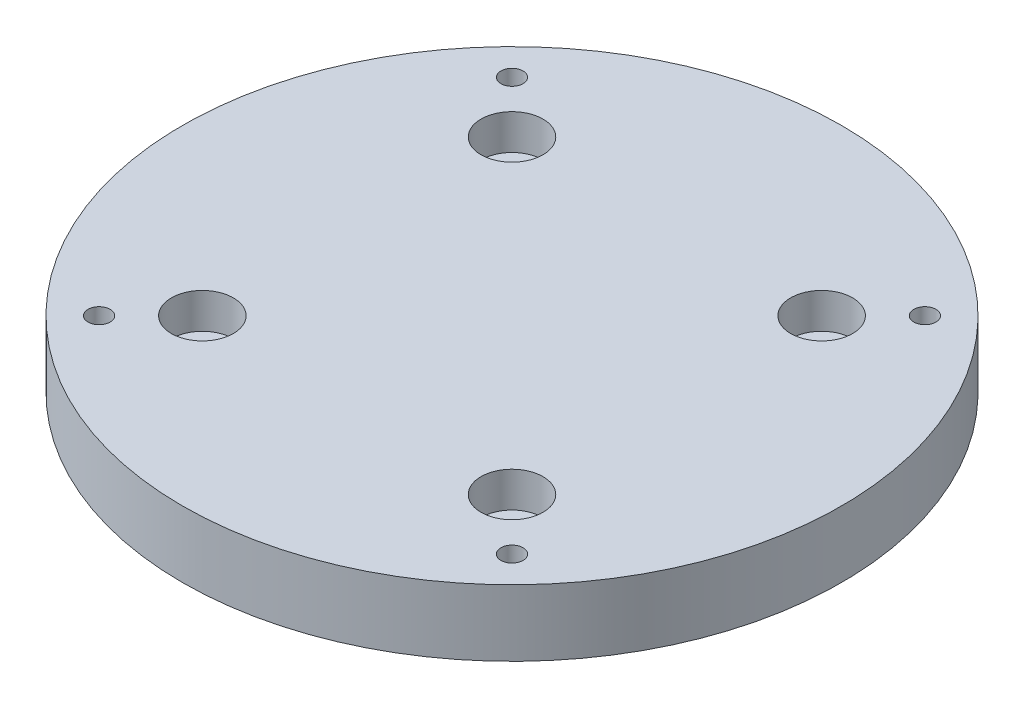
ISO-10303-21;
HEADER;
FILE_DESCRIPTION(('STEP AP214'),'2;1');
FILE_NAME('part.step','',(''),(''),'','','');
FILE_SCHEMA(('AUTOMOTIVE_DESIGN { 1 0 10303 214 1 1 1 1 }'));
ENDSEC;
DATA;
#1=APPLICATION_CONTEXT('core data for automotive mechanical design processes');
#2=APPLICATION_PROTOCOL_DEFINITION('international standard','automotive_design',2000,#1);
#3=PRODUCT_CONTEXT('',#1,'mechanical');
#4=PRODUCT('Part','Part','',(#3));
#5=PRODUCT_RELATED_PRODUCT_CATEGORY('part','',(#4));
#6=PRODUCT_DEFINITION_FORMATION('','',#4);
#7=PRODUCT_DEFINITION_CONTEXT('part definition',#1,'design');
#8=PRODUCT_DEFINITION('design','',#6,#7);
#9=PRODUCT_DEFINITION_SHAPE('','',#8);
#10=(LENGTH_UNIT() NAMED_UNIT(*) SI_UNIT(.MILLI.,.METRE.));
#11=(NAMED_UNIT(*) PLANE_ANGLE_UNIT() SI_UNIT($,.RADIAN.));
#12=(NAMED_UNIT(*) SI_UNIT($,.STERADIAN.) SOLID_ANGLE_UNIT());
#13=UNCERTAINTY_MEASURE_WITH_UNIT(LENGTH_MEASURE(1.E-05),#10,'distance_accuracy_value','');
#14=(GEOMETRIC_REPRESENTATION_CONTEXT(3) GLOBAL_UNCERTAINTY_ASSIGNED_CONTEXT((#13)) GLOBAL_UNIT_ASSIGNED_CONTEXT((#10,
#11,#12)) REPRESENTATION_CONTEXT('',''));
#15=CARTESIAN_POINT('',(0.,0.,0.));
#16=DIRECTION('',(0.,0.,1.));
#17=DIRECTION('',(1.,0.,0.));
#18=AXIS2_PLACEMENT_3D('',#15,#16,#17);
#19=CARTESIAN_POINT('',(-35.,0.,35.));
#20=DIRECTION('',(0.,1.,0.));
#21=DIRECTION('',(0.,0.,1.));
#22=AXIS2_PLACEMENT_3D('',#19,#20,#21);
#23=CYLINDRICAL_SURFACE('',#22,4.05);
#24=CARTESIAN_POINT('',(-35.,0.,35.));
#25=DIRECTION('',(0.,1.,0.));
#26=DIRECTION('',(0.,0.,1.));
#27=AXIS2_PLACEMENT_3D('',#24,#25,#26);
#28=CIRCLE('',#27,4.05);
#29=CARTESIAN_POINT('',(-35.,0.,39.05));
#30=VERTEX_POINT('',#29);
#31=EDGE_CURVE('E54',#30,#30,#28,.T.);
#32=ORIENTED_EDGE('',*,*,#31,.F.);
#33=EDGE_LOOP('',(#32));
#34=FACE_BOUND('',#33,.T.);
#35=CARTESIAN_POINT('',(-35.,7.,35.));
#36=DIRECTION('',(0.,1.,0.));
#37=DIRECTION('',(0.,0.,1.));
#38=AXIS2_PLACEMENT_3D('',#35,#36,#37);
#39=CIRCLE('',#38,4.05);
#40=CARTESIAN_POINT('',(-35.,7.,39.05));
#41=VERTEX_POINT('',#40);
#42=EDGE_CURVE('E37',#41,#41,#39,.F.);
#43=ORIENTED_EDGE('',*,*,#42,.F.);
#44=EDGE_LOOP('',(#43));
#45=FACE_BOUND('',#44,.T.);
#46=ADVANCED_FACE('F33',(#34,#45),#23,.F.);
#47=CARTESIAN_POINT('',(35.,0.,35.));
#48=DIRECTION('',(0.,1.,0.));
#49=DIRECTION('',(0.,0.,1.));
#50=AXIS2_PLACEMENT_3D('',#47,#48,#49);
#51=CYLINDRICAL_SURFACE('',#50,4.05);
#52=CARTESIAN_POINT('',(35.,0.,35.));
#53=DIRECTION('',(0.,1.,0.));
#54=DIRECTION('',(0.,0.,1.));
#55=AXIS2_PLACEMENT_3D('',#52,#53,#54);
#56=CIRCLE('',#55,4.05);
#57=CARTESIAN_POINT('',(35.,0.,39.05));
#58=VERTEX_POINT('',#57);
#59=EDGE_CURVE('E79',#58,#58,#56,.T.);
#60=ORIENTED_EDGE('',*,*,#59,.F.);
#61=EDGE_LOOP('',(#60));
#62=FACE_BOUND('',#61,.T.);
#63=CARTESIAN_POINT('',(35.,7.,35.));
#64=DIRECTION('',(0.,1.,0.));
#65=DIRECTION('',(0.,0.,1.));
#66=AXIS2_PLACEMENT_3D('',#63,#64,#65);
#67=CIRCLE('',#66,4.05);
#68=CARTESIAN_POINT('',(35.,7.,39.05));
#69=VERTEX_POINT('',#68);
#70=EDGE_CURVE('E58',#69,#69,#67,.F.);
#71=ORIENTED_EDGE('',*,*,#70,.F.);
#72=EDGE_LOOP('',(#71));
#73=FACE_BOUND('',#72,.T.);
#74=ADVANCED_FACE('F129',(#62,#73),#51,.F.);
#75=CARTESIAN_POINT('',(35.,0.,-35.));
#76=DIRECTION('',(0.,1.,0.));
#77=DIRECTION('',(0.,0.,1.));
#78=AXIS2_PLACEMENT_3D('',#75,#76,#77);
#79=CYLINDRICAL_SURFACE('',#78,4.05);
#80=CARTESIAN_POINT('',(35.,0.,-35.));
#81=DIRECTION('',(0.,1.,0.));
#82=DIRECTION('',(0.,0.,1.));
#83=AXIS2_PLACEMENT_3D('',#80,#81,#82);
#84=CIRCLE('',#83,4.05);
#85=CARTESIAN_POINT('',(35.,0.,-30.95));
#86=VERTEX_POINT('',#85);
#87=EDGE_CURVE('E75',#86,#86,#84,.T.);
#88=ORIENTED_EDGE('',*,*,#87,.F.);
#89=EDGE_LOOP('',(#88));
#90=FACE_BOUND('',#89,.T.);
#91=CARTESIAN_POINT('',(35.,7.,-35.));
#92=DIRECTION('',(0.,1.,0.));
#93=DIRECTION('',(0.,0.,1.));
#94=AXIS2_PLACEMENT_3D('',#91,#92,#93);
#95=CIRCLE('',#94,4.05);
#96=CARTESIAN_POINT('',(35.,7.,-30.95));
#97=VERTEX_POINT('',#96);
#98=EDGE_CURVE('E56',#97,#97,#95,.F.);
#99=ORIENTED_EDGE('',*,*,#98,.F.);
#100=EDGE_LOOP('',(#99));
#101=FACE_BOUND('',#100,.T.);
#102=ADVANCED_FACE('F136',(#90,#101),#79,.F.);
#103=CARTESIAN_POINT('',(-35.,0.,-35.));
#104=DIRECTION('',(0.,1.,0.));
#105=DIRECTION('',(0.,0.,1.));
#106=AXIS2_PLACEMENT_3D('',#103,#104,#105);
#107=CYLINDRICAL_SURFACE('',#106,4.05);
#108=CARTESIAN_POINT('',(-35.,0.,-35.));
#109=DIRECTION('',(0.,1.,0.));
#110=DIRECTION('',(0.,0.,1.));
#111=AXIS2_PLACEMENT_3D('',#108,#109,#110);
#112=CIRCLE('',#111,4.05);
#113=CARTESIAN_POINT('',(-35.,0.,-30.95));
#114=VERTEX_POINT('',#113);
#115=EDGE_CURVE('E78',#114,#114,#112,.T.);
#116=ORIENTED_EDGE('',*,*,#115,.F.);
#117=EDGE_LOOP('',(#116));
#118=FACE_BOUND('',#117,.T.);
#119=CARTESIAN_POINT('',(-35.,7.,-35.));
#120=DIRECTION('',(0.,1.,0.));
#121=DIRECTION('',(0.,0.,1.));
#122=AXIS2_PLACEMENT_3D('',#119,#120,#121);
#123=CIRCLE('',#122,4.05);
#124=CARTESIAN_POINT('',(-35.,7.,-30.95));
#125=VERTEX_POINT('',#124);
#126=EDGE_CURVE('E51',#125,#125,#123,.F.);
#127=ORIENTED_EDGE('',*,*,#126,.F.);
#128=EDGE_LOOP('',(#127));
#129=FACE_BOUND('',#128,.T.);
#130=ADVANCED_FACE('F143',(#118,#129),#107,.F.);
#131=CARTESIAN_POINT('',(0.,15.,0.));
#132=DIRECTION('',(0.,-1.,0.));
#133=DIRECTION('',(0.,0.,-1.));
#134=AXIS2_PLACEMENT_3D('',#131,#132,#133);
#135=CYLINDRICAL_SURFACE('',#134,74.5);
#136=CARTESIAN_POINT('',(0.,15.,0.));
#137=DIRECTION('',(0.,1.,0.));
#138=DIRECTION('',(0.,0.,1.));
#139=AXIS2_PLACEMENT_3D('',#136,#137,#138);
#140=CIRCLE('',#139,74.5);
#141=CARTESIAN_POINT('',(0.,15.,74.5));
#142=VERTEX_POINT('',#141);
#143=EDGE_CURVE('E10',#142,#142,#140,.T.);
#144=ORIENTED_EDGE('',*,*,#143,.F.);
#145=EDGE_LOOP('',(#144));
#146=FACE_BOUND('',#145,.T.);
#147=CARTESIAN_POINT('',(0.,0.,0.));
#148=DIRECTION('',(0.,1.,0.));
#149=DIRECTION('',(0.,0.,1.));
#150=AXIS2_PLACEMENT_3D('',#147,#148,#149);
#151=CIRCLE('',#150,74.5);
#152=CARTESIAN_POINT('',(0.,0.,74.5));
#153=VERTEX_POINT('',#152);
#154=EDGE_CURVE('E41',#153,#153,#151,.T.);
#155=ORIENTED_EDGE('',*,*,#154,.T.);
#156=EDGE_LOOP('',(#155));
#157=FACE_BOUND('',#156,.T.);
#158=ADVANCED_FACE('F35',(#146,#157),#135,.T.);
#159=CARTESIAN_POINT('',(0.,15.,0.));
#160=DIRECTION('',(0.,1.,0.));
#161=DIRECTION('',(0.,0.,1.));
#162=AXIS2_PLACEMENT_3D('',#159,#160,#161);
#163=PLANE('',#162);
#164=CARTESIAN_POINT('',(35.,15.,-35.));
#165=DIRECTION('',(0.,1.,0.));
#166=DIRECTION('',(0.,0.,1.));
#167=AXIS2_PLACEMENT_3D('',#164,#165,#166);
#168=CIRCLE('',#167,7.);
#169=CARTESIAN_POINT('',(35.,15.,-28.));
#170=VERTEX_POINT('',#169);
#171=EDGE_CURVE('E174',#170,#170,#168,.T.);
#172=ORIENTED_EDGE('',*,*,#171,.F.);
#173=EDGE_LOOP('',(#172));
#174=FACE_BOUND('',#173,.T.);
#175=CARTESIAN_POINT('',(35.,15.,35.));
#176=DIRECTION('',(0.,1.,0.));
#177=DIRECTION('',(0.,0.,1.));
#178=AXIS2_PLACEMENT_3D('',#175,#176,#177);
#179=CIRCLE('',#178,7.);
#180=CARTESIAN_POINT('',(35.,15.,42.));
#181=VERTEX_POINT('',#180);
#182=EDGE_CURVE('E178',#181,#181,#179,.T.);
#183=ORIENTED_EDGE('',*,*,#182,.F.);
#184=EDGE_LOOP('',(#183));
#185=FACE_BOUND('',#184,.T.);
#186=CARTESIAN_POINT('',(-35.,15.,35.));
#187=DIRECTION('',(0.,1.,0.));
#188=DIRECTION('',(0.,0.,1.));
#189=AXIS2_PLACEMENT_3D('',#186,#187,#188);
#190=CIRCLE('',#189,7.);
#191=CARTESIAN_POINT('',(-35.,15.,42.));
#192=VERTEX_POINT('',#191);
#193=EDGE_CURVE('E182',#192,#192,#190,.T.);
#194=ORIENTED_EDGE('',*,*,#193,.F.);
#195=EDGE_LOOP('',(#194));
#196=FACE_BOUND('',#195,.T.);
#197=CARTESIAN_POINT('',(-35.,15.,-35.));
#198=DIRECTION('',(0.,1.,0.));
#199=DIRECTION('',(0.,0.,1.));
#200=AXIS2_PLACEMENT_3D('',#197,#198,#199);
#201=CIRCLE('',#200,7.);
#202=CARTESIAN_POINT('',(-35.,15.,-28.));
#203=VERTEX_POINT('',#202);
#204=EDGE_CURVE('E64',#203,#203,#201,.T.);
#205=ORIENTED_EDGE('',*,*,#204,.F.);
#206=EDGE_LOOP('',(#205));
#207=FACE_BOUND('',#206,.T.);
#208=CARTESIAN_POINT('',(46.6690475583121,15.,-46.6690475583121));
#209=DIRECTION('',(0.,1.,0.));
#210=DIRECTION('',(0.,0.,1.));
#211=AXIS2_PLACEMENT_3D('',#208,#209,#210);
#212=CIRCLE('',#211,2.49999999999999);
#213=CARTESIAN_POINT('',(46.6690475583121,15.,-44.1690475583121));
#214=VERTEX_POINT('',#213);
#215=EDGE_CURVE('E86',#214,#214,#212,.T.);
#216=ORIENTED_EDGE('',*,*,#215,.F.);
#217=EDGE_LOOP('',(#216));
#218=FACE_BOUND('',#217,.T.);
#219=CARTESIAN_POINT('',(-46.6690475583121,15.,-46.6690475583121));
#220=DIRECTION('',(0.,1.,0.));
#221=DIRECTION('',(0.,0.,1.));
#222=AXIS2_PLACEMENT_3D('',#219,#220,#221);
#223=CIRCLE('',#222,2.49999999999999);
#224=CARTESIAN_POINT('',(-46.6690475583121,15.,-44.1690475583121));
#225=VERTEX_POINT('',#224);
#226=EDGE_CURVE('E92',#225,#225,#223,.T.);
#227=ORIENTED_EDGE('',*,*,#226,.F.);
#228=EDGE_LOOP('',(#227));
#229=FACE_BOUND('',#228,.T.);
#230=CARTESIAN_POINT('',(-46.6690475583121,15.,46.6690475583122));
#231=DIRECTION('',(0.,1.,0.));
#232=DIRECTION('',(0.,0.,1.));
#233=AXIS2_PLACEMENT_3D('',#230,#231,#232);
#234=CIRCLE('',#233,2.49999999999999);
#235=CARTESIAN_POINT('',(-46.6690475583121,15.,49.1690475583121));
#236=VERTEX_POINT('',#235);
#237=EDGE_CURVE('E98',#236,#236,#234,.T.);
#238=ORIENTED_EDGE('',*,*,#237,.F.);
#239=EDGE_LOOP('',(#238));
#240=FACE_BOUND('',#239,.T.);
#241=CARTESIAN_POINT('',(46.6690475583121,15.,46.6690475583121));
#242=DIRECTION('',(0.,1.,0.));
#243=DIRECTION('',(0.,0.,1.));
#244=AXIS2_PLACEMENT_3D('',#241,#242,#243);
#245=CIRCLE('',#244,2.49999999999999);
#246=CARTESIAN_POINT('',(46.6690475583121,15.,49.1690475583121));
#247=VERTEX_POINT('',#246);
#248=EDGE_CURVE('E103',#247,#247,#245,.T.);
#249=ORIENTED_EDGE('',*,*,#248,.F.);
#250=EDGE_LOOP('',(#249));
#251=FACE_BOUND('',#250,.T.);
#252=ORIENTED_EDGE('',*,*,#143,.T.);
#253=EDGE_LOOP('',(#252));
#254=FACE_BOUND('',#253,.T.);
#255=ADVANCED_FACE('F125',(#174,#185,#196,#207,#218,#229,#240,#251,#254),#163,.T.);
#256=CARTESIAN_POINT('',(0.,0.,0.));
#257=DIRECTION('',(0.,1.,0.));
#258=DIRECTION('',(0.,0.,1.));
#259=AXIS2_PLACEMENT_3D('',#256,#257,#258);
#260=PLANE('',#259);
#261=ORIENTED_EDGE('',*,*,#87,.T.);
#262=EDGE_LOOP('',(#261));
#263=FACE_BOUND('',#262,.T.);
#264=ORIENTED_EDGE('',*,*,#59,.T.);
#265=EDGE_LOOP('',(#264));
#266=FACE_BOUND('',#265,.T.);
#267=ORIENTED_EDGE('',*,*,#31,.T.);
#268=EDGE_LOOP('',(#267));
#269=FACE_BOUND('',#268,.T.);
#270=ORIENTED_EDGE('',*,*,#115,.T.);
#271=EDGE_LOOP('',(#270));
#272=FACE_BOUND('',#271,.T.);
#273=CARTESIAN_POINT('',(46.6690475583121,0.,-46.6690475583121));
#274=DIRECTION('',(0.,1.,0.));
#275=DIRECTION('',(0.,0.,1.));
#276=AXIS2_PLACEMENT_3D('',#273,#274,#275);
#277=CIRCLE('',#276,2.5);
#278=CARTESIAN_POINT('',(46.6690475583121,0.,-44.1690475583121));
#279=VERTEX_POINT('',#278);
#280=EDGE_CURVE('E89',#279,#279,#277,.T.);
#281=ORIENTED_EDGE('',*,*,#280,.T.);
#282=EDGE_LOOP('',(#281));
#283=FACE_BOUND('',#282,.T.);
#284=CARTESIAN_POINT('',(-46.6690475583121,0.,-46.6690475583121));
#285=DIRECTION('',(0.,1.,0.));
#286=DIRECTION('',(0.,0.,1.));
#287=AXIS2_PLACEMENT_3D('',#284,#285,#286);
#288=CIRCLE('',#287,2.5);
#289=CARTESIAN_POINT('',(-46.6690475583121,0.,-44.1690475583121));
#290=VERTEX_POINT('',#289);
#291=EDGE_CURVE('E95',#290,#290,#288,.T.);
#292=ORIENTED_EDGE('',*,*,#291,.T.);
#293=EDGE_LOOP('',(#292));
#294=FACE_BOUND('',#293,.T.);
#295=CARTESIAN_POINT('',(-46.6690475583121,0.,46.6690475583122));
#296=DIRECTION('',(0.,1.,0.));
#297=DIRECTION('',(0.,0.,1.));
#298=AXIS2_PLACEMENT_3D('',#295,#296,#297);
#299=CIRCLE('',#298,2.5);
#300=CARTESIAN_POINT('',(-46.6690475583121,0.,49.1690475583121));
#301=VERTEX_POINT('',#300);
#302=EDGE_CURVE('E101',#301,#301,#299,.T.);
#303=ORIENTED_EDGE('',*,*,#302,.T.);
#304=EDGE_LOOP('',(#303));
#305=FACE_BOUND('',#304,.T.);
#306=CARTESIAN_POINT('',(46.6690475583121,0.,46.6690475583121));
#307=DIRECTION('',(0.,1.,0.));
#308=DIRECTION('',(0.,0.,1.));
#309=AXIS2_PLACEMENT_3D('',#306,#307,#308);
#310=CIRCLE('',#309,2.5);
#311=CARTESIAN_POINT('',(46.6690475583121,0.,49.1690475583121));
#312=VERTEX_POINT('',#311);
#313=EDGE_CURVE('E46',#312,#312,#310,.T.);
#314=ORIENTED_EDGE('',*,*,#313,.T.);
#315=EDGE_LOOP('',(#314));
#316=FACE_BOUND('',#315,.T.);
#317=ORIENTED_EDGE('',*,*,#154,.F.);
#318=EDGE_LOOP('',(#317));
#319=FACE_BOUND('',#318,.T.);
#320=ADVANCED_FACE('F110',(#263,#266,#269,#272,#283,#294,#305,#316,#319),#260,.F.);
#321=CARTESIAN_POINT('',(46.6690475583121,15.,46.6690475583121));
#322=DIRECTION('',(0.,1.,0.));
#323=DIRECTION('',(0.,0.,1.));
#324=AXIS2_PLACEMENT_3D('',#321,#322,#323);
#325=CYLINDRICAL_SURFACE('',#324,2.49999999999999);
#326=ORIENTED_EDGE('',*,*,#313,.F.);
#327=EDGE_LOOP('',(#326));
#328=FACE_BOUND('',#327,.T.);
#329=ORIENTED_EDGE('',*,*,#248,.T.);
#330=EDGE_LOOP('',(#329));
#331=FACE_BOUND('',#330,.T.);
#332=ADVANCED_FACE('F113',(#328,#331),#325,.F.);
#333=CARTESIAN_POINT('',(-46.6690475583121,15.,46.6690475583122));
#334=DIRECTION('',(0.,1.,0.));
#335=DIRECTION('',(0.,0.,1.));
#336=AXIS2_PLACEMENT_3D('',#333,#334,#335);
#337=CYLINDRICAL_SURFACE('',#336,2.49999999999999);
#338=ORIENTED_EDGE('',*,*,#302,.F.);
#339=EDGE_LOOP('',(#338));
#340=FACE_BOUND('',#339,.T.);
#341=ORIENTED_EDGE('',*,*,#237,.T.);
#342=EDGE_LOOP('',(#341));
#343=FACE_BOUND('',#342,.T.);
#344=ADVANCED_FACE('F115',(#340,#343),#337,.F.);
#345=CARTESIAN_POINT('',(-46.6690475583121,15.,-46.6690475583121));
#346=DIRECTION('',(0.,1.,0.));
#347=DIRECTION('',(0.,0.,1.));
#348=AXIS2_PLACEMENT_3D('',#345,#346,#347);
#349=CYLINDRICAL_SURFACE('',#348,2.49999999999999);
#350=ORIENTED_EDGE('',*,*,#291,.F.);
#351=EDGE_LOOP('',(#350));
#352=FACE_BOUND('',#351,.T.);
#353=ORIENTED_EDGE('',*,*,#226,.T.);
#354=EDGE_LOOP('',(#353));
#355=FACE_BOUND('',#354,.T.);
#356=ADVANCED_FACE('F121',(#352,#355),#349,.F.);
#357=CARTESIAN_POINT('',(46.6690475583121,15.,-46.6690475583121));
#358=DIRECTION('',(0.,1.,0.));
#359=DIRECTION('',(0.,0.,1.));
#360=AXIS2_PLACEMENT_3D('',#357,#358,#359);
#361=CYLINDRICAL_SURFACE('',#360,2.49999999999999);
#362=ORIENTED_EDGE('',*,*,#280,.F.);
#363=EDGE_LOOP('',(#362));
#364=FACE_BOUND('',#363,.T.);
#365=ORIENTED_EDGE('',*,*,#215,.T.);
#366=EDGE_LOOP('',(#365));
#367=FACE_BOUND('',#366,.T.);
#368=ADVANCED_FACE('F147',(#364,#367),#361,.F.);
#369=CARTESIAN_POINT('',(-35.,7.,-35.));
#370=DIRECTION('',(0.,1.,0.));
#371=DIRECTION('',(0.,0.,1.));
#372=AXIS2_PLACEMENT_3D('',#369,#370,#371);
#373=PLANE('',#372);
#374=CARTESIAN_POINT('',(-35.,7.,-35.));
#375=DIRECTION('',(0.,1.,0.));
#376=DIRECTION('',(0.,0.,1.));
#377=AXIS2_PLACEMENT_3D('',#374,#375,#376);
#378=CIRCLE('',#377,7.);
#379=CARTESIAN_POINT('',(-35.,7.,-28.));
#380=VERTEX_POINT('',#379);
#381=EDGE_CURVE('E55',#380,#380,#378,.T.);
#382=ORIENTED_EDGE('',*,*,#381,.T.);
#383=EDGE_LOOP('',(#382));
#384=FACE_BOUND('',#383,.T.);
#385=ORIENTED_EDGE('',*,*,#126,.T.);
#386=EDGE_LOOP('',(#385));
#387=FACE_BOUND('',#386,.T.);
#388=ADVANCED_FACE('F149',(#384,#387),#373,.T.);
#389=CARTESIAN_POINT('',(-35.,7.,-35.));
#390=DIRECTION('',(0.,1.,0.));
#391=DIRECTION('',(0.,0.,1.));
#392=AXIS2_PLACEMENT_3D('',#389,#390,#391);
#393=CYLINDRICAL_SURFACE('',#392,7.);
#394=ORIENTED_EDGE('',*,*,#381,.F.);
#395=EDGE_LOOP('',(#394));
#396=FACE_BOUND('',#395,.T.);
#397=ORIENTED_EDGE('',*,*,#204,.T.);
#398=EDGE_LOOP('',(#397));
#399=FACE_BOUND('',#398,.T.);
#400=ADVANCED_FACE('F214',(#396,#399),#393,.F.);
#401=CARTESIAN_POINT('',(35.,7.,-35.));
#402=DIRECTION('',(0.,1.,0.));
#403=DIRECTION('',(0.,0.,1.));
#404=AXIS2_PLACEMENT_3D('',#401,#402,#403);
#405=PLANE('',#404);
#406=CARTESIAN_POINT('',(35.,7.,-35.));
#407=DIRECTION('',(0.,1.,0.));
#408=DIRECTION('',(0.,0.,1.));
#409=AXIS2_PLACEMENT_3D('',#406,#407,#408);
#410=CIRCLE('',#409,7.);
#411=CARTESIAN_POINT('',(35.,7.,-28.));
#412=VERTEX_POINT('',#411);
#413=EDGE_CURVE('E59',#412,#412,#410,.T.);
#414=ORIENTED_EDGE('',*,*,#413,.T.);
#415=EDGE_LOOP('',(#414));
#416=FACE_BOUND('',#415,.T.);
#417=ORIENTED_EDGE('',*,*,#98,.T.);
#418=EDGE_LOOP('',(#417));
#419=FACE_BOUND('',#418,.T.);
#420=ADVANCED_FACE('F199',(#416,#419),#405,.T.);
#421=CARTESIAN_POINT('',(35.,7.,-35.));
#422=DIRECTION('',(0.,1.,0.));
#423=DIRECTION('',(0.,0.,1.));
#424=AXIS2_PLACEMENT_3D('',#421,#422,#423);
#425=CYLINDRICAL_SURFACE('',#424,7.);
#426=ORIENTED_EDGE('',*,*,#413,.F.);
#427=EDGE_LOOP('',(#426));
#428=FACE_BOUND('',#427,.T.);
#429=ORIENTED_EDGE('',*,*,#171,.T.);
#430=EDGE_LOOP('',(#429));
#431=FACE_BOUND('',#430,.T.);
#432=ADVANCED_FACE('F202',(#428,#431),#425,.F.);
#433=CARTESIAN_POINT('',(35.,7.,35.));
#434=DIRECTION('',(0.,1.,0.));
#435=DIRECTION('',(0.,0.,1.));
#436=AXIS2_PLACEMENT_3D('',#433,#434,#435);
#437=PLANE('',#436);
#438=CARTESIAN_POINT('',(35.,7.,35.));
#439=DIRECTION('',(0.,1.,0.));
#440=DIRECTION('',(0.,0.,1.));
#441=AXIS2_PLACEMENT_3D('',#438,#439,#440);
#442=CIRCLE('',#441,7.);
#443=CARTESIAN_POINT('',(35.,7.,42.));
#444=VERTEX_POINT('',#443);
#445=EDGE_CURVE('E192',#444,#444,#442,.T.);
#446=ORIENTED_EDGE('',*,*,#445,.T.);
#447=EDGE_LOOP('',(#446));
#448=FACE_BOUND('',#447,.T.);
#449=ORIENTED_EDGE('',*,*,#70,.T.);
#450=EDGE_LOOP('',(#449));
#451=FACE_BOUND('',#450,.T.);
#452=ADVANCED_FACE('F205',(#448,#451),#437,.T.);
#453=CARTESIAN_POINT('',(35.,7.,35.));
#454=DIRECTION('',(0.,1.,0.));
#455=DIRECTION('',(0.,0.,1.));
#456=AXIS2_PLACEMENT_3D('',#453,#454,#455);
#457=CYLINDRICAL_SURFACE('',#456,7.);
#458=ORIENTED_EDGE('',*,*,#445,.F.);
#459=EDGE_LOOP('',(#458));
#460=FACE_BOUND('',#459,.T.);
#461=ORIENTED_EDGE('',*,*,#182,.T.);
#462=EDGE_LOOP('',(#461));
#463=FACE_BOUND('',#462,.T.);
#464=ADVANCED_FACE('F211',(#460,#463),#457,.F.);
#465=CARTESIAN_POINT('',(-35.,7.,35.));
#466=DIRECTION('',(0.,1.,0.));
#467=DIRECTION('',(0.,0.,1.));
#468=AXIS2_PLACEMENT_3D('',#465,#466,#467);
#469=PLANE('',#468);
#470=CARTESIAN_POINT('',(-35.,7.,35.));
#471=DIRECTION('',(0.,1.,0.));
#472=DIRECTION('',(0.,0.,1.));
#473=AXIS2_PLACEMENT_3D('',#470,#471,#472);
#474=CIRCLE('',#473,7.);
#475=CARTESIAN_POINT('',(-35.,7.,42.));
#476=VERTEX_POINT('',#475);
#477=EDGE_CURVE('E187',#476,#476,#474,.T.);
#478=ORIENTED_EDGE('',*,*,#477,.T.);
#479=EDGE_LOOP('',(#478));
#480=FACE_BOUND('',#479,.T.);
#481=ORIENTED_EDGE('',*,*,#42,.T.);
#482=EDGE_LOOP('',(#481));
#483=FACE_BOUND('',#482,.T.);
#484=ADVANCED_FACE('F219',(#480,#483),#469,.T.);
#485=CARTESIAN_POINT('',(-35.,7.,35.));
#486=DIRECTION('',(0.,1.,0.));
#487=DIRECTION('',(0.,0.,1.));
#488=AXIS2_PLACEMENT_3D('',#485,#486,#487);
#489=CYLINDRICAL_SURFACE('',#488,7.);
#490=ORIENTED_EDGE('',*,*,#477,.F.);
#491=EDGE_LOOP('',(#490));
#492=FACE_BOUND('',#491,.T.);
#493=ORIENTED_EDGE('',*,*,#193,.T.);
#494=EDGE_LOOP('',(#493));
#495=FACE_BOUND('',#494,.T.);
#496=ADVANCED_FACE('F223',(#492,#495),#489,.F.);
#497=CLOSED_SHELL('',(#46,#74,#102,#130,#158,#255,#320,#332,#344,#356,#368,#388,#400,#420,#432,
#452,#464,#484,#496));
#498=MANIFOLD_SOLID_BREP('B2',#497);
#499=ADVANCED_BREP_SHAPE_REPRESENTATION('',(#18,#498),#14);
#500=SHAPE_DEFINITION_REPRESENTATION(#9,#499);
ENDSEC;
END-ISO-10303-21;
